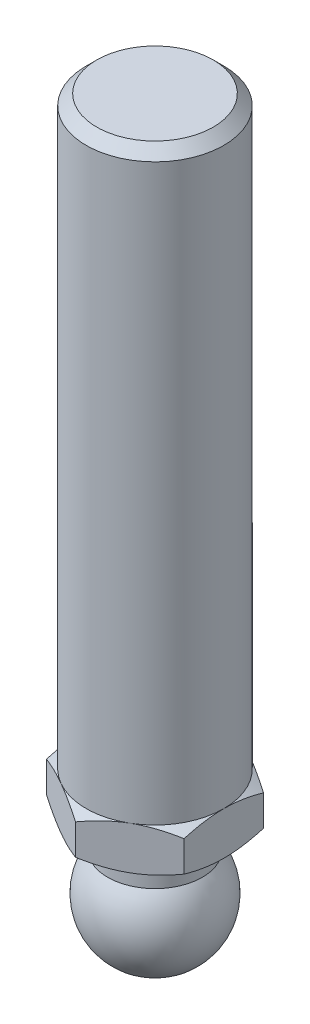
ISO-10303-21;
HEADER;
FILE_DESCRIPTION(('STEP AP214'),'2;1');
FILE_NAME('part.step','',(''),(''),'','','');
FILE_SCHEMA(('AUTOMOTIVE_DESIGN { 1 0 10303 214 1 1 1 1 }'));
ENDSEC;
DATA;
#1=APPLICATION_CONTEXT('core data for automotive mechanical design processes');
#2=APPLICATION_PROTOCOL_DEFINITION('international standard','automotive_design',2000,#1);
#3=PRODUCT_CONTEXT('',#1,'mechanical');
#4=PRODUCT('Part','Part','',(#3));
#5=PRODUCT_RELATED_PRODUCT_CATEGORY('part','',(#4));
#6=PRODUCT_DEFINITION_FORMATION('','',#4);
#7=PRODUCT_DEFINITION_CONTEXT('part definition',#1,'design');
#8=PRODUCT_DEFINITION('design','',#6,#7);
#9=PRODUCT_DEFINITION_SHAPE('','',#8);
#10=(LENGTH_UNIT() NAMED_UNIT(*) SI_UNIT(.MILLI.,.METRE.));
#11=(NAMED_UNIT(*) PLANE_ANGLE_UNIT() SI_UNIT($,.RADIAN.));
#12=(NAMED_UNIT(*) SI_UNIT($,.STERADIAN.) SOLID_ANGLE_UNIT());
#13=UNCERTAINTY_MEASURE_WITH_UNIT(LENGTH_MEASURE(1.E-05),#10,'distance_accuracy_value','');
#14=(GEOMETRIC_REPRESENTATION_CONTEXT(3) GLOBAL_UNCERTAINTY_ASSIGNED_CONTEXT((#13)) GLOBAL_UNIT_ASSIGNED_CONTEXT((#10,
#11,#12)) REPRESENTATION_CONTEXT('',''));
#15=CARTESIAN_POINT('',(0.,0.,0.));
#16=DIRECTION('',(0.,0.,1.));
#17=DIRECTION('',(1.,0.,0.));
#18=AXIS2_PLACEMENT_3D('',#15,#16,#17);
#19=CARTESIAN_POINT('',(0.,19.5,0.));
#20=DIRECTION('',(0.,-1.,0.));
#21=DIRECTION('',(0.,0.,-1.));
#22=AXIS2_PLACEMENT_3D('',#19,#20,#21);
#23=CONICAL_SURFACE('',#22,8.,1.0471975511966);
#24=CARTESIAN_POINT('',(-8.,14.714451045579,14.1889203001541));
#25=CARTESIAN_POINT('',(-8.,14.8842783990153,13.851186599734));
#26=CARTESIAN_POINT('',(-8.,15.0529801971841,13.5128811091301));
#27=CARTESIAN_POINT('',(-8.,15.3875863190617,12.8348638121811));
#28=CARTESIAN_POINT('',(-8.,15.553490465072,12.4951519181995));
#29=CARTESIAN_POINT('',(-8.,15.8822522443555,11.8134403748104));
#30=CARTESIAN_POINT('',(-8.,16.0451033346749,11.4714375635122));
#31=CARTESIAN_POINT('',(-8.,16.3666666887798,10.7854960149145));
#32=CARTESIAN_POINT('',(-8.,16.5253790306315,10.4415573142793));
#33=CARTESIAN_POINT('',(-8.,16.8449502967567,9.73535271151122));
#34=CARTESIAN_POINT('',(-8.,17.0055671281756,9.37297690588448));
#35=CARTESIAN_POINT('',(-8.,17.3197730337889,8.64516064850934));
#36=CARTESIAN_POINT('',(-8.,17.4733617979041,8.27972006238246));
#37=CARTESIAN_POINT('',(-8.,17.7714937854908,7.54540420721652));
#38=CARTESIAN_POINT('',(-8.,17.9160424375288,7.1765311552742));
#39=CARTESIAN_POINT('',(-8.,18.1936308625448,6.43449862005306));
#40=CARTESIAN_POINT('',(-8.,18.3266718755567,6.06133960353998));
#41=CARTESIAN_POINT('',(-8.,18.605819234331,5.22677195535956));
#42=CARTESIAN_POINT('',(-8.,18.7482891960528,4.76412920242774));
#43=CARTESIAN_POINT('',(-8.,19.0033463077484,3.83044032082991));
#44=CARTESIAN_POINT('',(-8.,19.115935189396,3.3593946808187));
#45=CARTESIAN_POINT('',(-8.,19.2546281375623,2.651184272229));
#46=CARTESIAN_POINT('',(-8.,19.2955954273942,2.41690742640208));
#47=CARTESIAN_POINT('',(-8.,19.3670123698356,1.94676929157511));
#48=CARTESIAN_POINT('',(-8.,19.3974635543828,1.71090823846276));
#49=CARTESIAN_POINT('',(-8.,19.4469446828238,1.23805721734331));
#50=CARTESIAN_POINT('',(-8.,19.4659782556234,1.0010676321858));
#51=CARTESIAN_POINT('',(-8.,19.4920206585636,0.526423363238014));
#52=CARTESIAN_POINT('',(-8.,19.499029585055,0.288768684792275));
#53=CARTESIAN_POINT('',(-8.,19.5007883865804,-0.188309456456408));
#54=CARTESIAN_POINT('',(-8.,19.4954490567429,-0.427733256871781));
#55=CARTESIAN_POINT('',(-8.,19.4725128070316,-0.905988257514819));
#56=CARTESIAN_POINT('',(-8.,19.4549157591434,-1.14481945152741));
#57=CARTESIAN_POINT('',(-8.,19.4080408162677,-1.62141631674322));
#58=CARTESIAN_POINT('',(-8.,19.3787584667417,-1.85918154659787));
#59=CARTESIAN_POINT('',(-8.,19.3094074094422,-2.33311174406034));
#60=CARTESIAN_POINT('',(-8.,19.2693385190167,-2.56927668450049));
#61=CARTESIAN_POINT('',(-8.,19.1329562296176,-3.28330816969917));
#62=CARTESIAN_POINT('',(-8.,19.0213579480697,-3.75830022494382));
#63=CARTESIAN_POINT('',(-8.,18.830875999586,-4.46428489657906));
#64=CARTESIAN_POINT('',(-8.,18.7635265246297,-4.69855285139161));
#65=CARTESIAN_POINT('',(-8.,18.6221775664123,-5.16507806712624));
#66=CARTESIAN_POINT('',(-8.,18.5481783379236,-5.39733540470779));
#67=CARTESIAN_POINT('',(-8.,18.3456232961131,-6.00705809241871));
#68=CARTESIAN_POINT('',(-8.,18.2123002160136,-6.38293491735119));
#69=CARTESIAN_POINT('',(-8.,17.9338794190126,-7.13030495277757));
#70=CARTESIAN_POINT('',(-8.,17.7887803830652,-7.50179766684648));
#71=CARTESIAN_POINT('',(-8.,17.4893388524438,-8.24128843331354));
#72=CARTESIAN_POINT('',(-8.,17.3349906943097,-8.60928418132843));
#73=CARTESIAN_POINT('',(-8.,17.0191219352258,-9.34215095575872));
#74=CARTESIAN_POINT('',(-8.,16.8576016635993,-9.70702212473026));
#75=CARTESIAN_POINT('',(-8.,16.5362228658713,-10.4179250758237));
#76=CARTESIAN_POINT('',(-8.,16.3766130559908,-10.7640696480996));
#77=CARTESIAN_POINT('',(-8.,16.0531867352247,-11.4543922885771));
#78=CARTESIAN_POINT('',(-8.,15.8893701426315,-11.798570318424));
#79=CARTESIAN_POINT('',(-8.,15.558638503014,-12.4845836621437));
#80=CARTESIAN_POINT('',(-8.,15.3917303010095,-12.8264222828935));
#81=CARTESIAN_POINT('',(-8.,15.0550779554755,-13.5086735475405));
#82=CARTESIAN_POINT('',(-8.,14.8853339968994,-13.8490862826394));
#83=CARTESIAN_POINT('',(-8.,14.714451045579,-14.1889203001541));
#84=B_SPLINE_CURVE_WITH_KNOTS('',3,(#24,#25,#26,#27,#28,#29,#30,#31,#32,#33,#34,#35,#36,#37,#38,
#39,#40,#41,#42,#43,#44,#45,#46,#47,#48,#49,#50,#51,#52,#53,#54,#55,#56,#57,#58,#59,#60,#61,#62,
#63,#64,#65,#66,#67,#68,#69,#70,#71,#72,#73,#74,#75,#76,#77,#78,#79,#80,#81,#82,#83),
.UNSPECIFIED.,.F.,.F.,(4,2,2,2,2,2,2,2,2,2,2,2,2,2,2,2,2,2,2,2,2,2,2,2,2,2,2,2,2,4),(0.,
1.13409047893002,2.26825272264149,3.40461779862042,4.5409614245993,5.73003075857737,
6.91915250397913,8.10755318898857,9.29582565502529,10.7473798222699,12.1988498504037,
12.9121466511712,13.6253394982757,14.3383055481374,15.0512658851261,15.7693927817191,
16.487527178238,17.2059355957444,17.9243561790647,19.38648697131,20.1177019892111,
20.8488890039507,22.0450800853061,23.2414053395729,24.4384707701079,25.6354812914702,
26.7789606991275,27.9224623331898,29.063679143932,30.2048218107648),.UNSPECIFIED.);
#85=CARTESIAN_POINT('',(-8.,18.7854688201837,4.61880215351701));
#86=VERTEX_POINT('',#85);
#87=CARTESIAN_POINT('',(-8.,19.5,0.));
#88=VERTEX_POINT('',#87);
#89=EDGE_CURVE('E253',#86,#88,#84,.T.);
#90=ORIENTED_EDGE('',*,*,#89,.F.);
#91=CARTESIAN_POINT('',(0.0002,18.7854021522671,9.23771977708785));
#92=CARTESIAN_POINT('',(-0.175648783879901,18.8440092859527,9.13619343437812));
#93=CARTESIAN_POINT('',(-0.352153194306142,18.8999565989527,9.03428856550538));
#94=CARTESIAN_POINT('',(-0.706595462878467,19.0057989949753,8.82965122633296));
#95=CARTESIAN_POINT('',(-0.884533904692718,19.0556914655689,8.72691841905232));
#96=CARTESIAN_POINT('',(-1.42119823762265,19.1953072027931,8.41707512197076));
#97=CARTESIAN_POINT('',(-1.78204258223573,19.2747188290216,8.20874154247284));
#98=CARTESIAN_POINT('',(-2.32203917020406,19.3678383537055,7.89697436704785));
#99=CARTESIAN_POINT('',(-2.49957818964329,19.3943654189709,7.79447216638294));
#100=CARTESIAN_POINT('',(-2.85545911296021,19.4388468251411,7.58900421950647));
#101=CARTESIAN_POINT('',(-3.03380094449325,19.4568019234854,7.4860385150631));
#102=CARTESIAN_POINT('',(-3.3907916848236,19.4836843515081,7.27992981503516));
#103=CARTESIAN_POINT('',(-3.56944001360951,19.4926219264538,7.17678715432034));
#104=CARTESIAN_POINT('',(-3.92690170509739,19.5012776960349,6.97040655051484));
#105=CARTESIAN_POINT('',(-4.10571506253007,19.5009961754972,6.86716861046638));
#106=CARTESIAN_POINT('',(-4.44001336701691,19.4918549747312,6.67416139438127));
#107=CARTESIAN_POINT('',(-4.59552190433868,19.4841103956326,6.58437849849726));
#108=CARTESIAN_POINT('',(-4.90617476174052,19.4617988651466,6.40502298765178));
#109=CARTESIAN_POINT('',(-5.06131905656,19.4472314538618,6.31545038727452));
#110=CARTESIAN_POINT('',(-5.52615131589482,19.3936393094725,6.04707935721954));
#111=CARTESIAN_POINT('',(-5.83501648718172,19.3447313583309,5.86875596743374));
#112=CARTESIAN_POINT('',(-6.4560232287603,19.2224605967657,5.51021755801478));
#113=CARTESIAN_POINT('',(-6.76808554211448,19.148579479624,5.33004829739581));
#114=CARTESIAN_POINT('',(-7.38755648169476,18.980899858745,4.97239658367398));
#115=CARTESIAN_POINT('',(-7.69497304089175,18.8871407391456,4.79490955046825));
#116=CARTESIAN_POINT('',(-8.0002,18.7854021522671,4.61868668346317));
#117=B_SPLINE_CURVE_WITH_KNOTS('',3,(#91,#92,#93,#94,#95,#96,#97,#98,#99,#100,#101,#102,#103,
#104,#105,#106,#107,#108,#109,#110,#111,#112,#113,#114,#115,#116),.UNSPECIFIED.,.F.,.F.,(4,2,2,
2,2,2,2,2,2,2,2,2,4),(0.,0.633973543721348,1.26821965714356,2.53934712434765,3.15934343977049,
3.77928496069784,4.39852133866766,5.01773858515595,5.55680239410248,6.09590254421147,
7.17487077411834,8.27776850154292,9.37850115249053),.UNSPECIFIED.);
#118=CARTESIAN_POINT('',(-4.,19.5,6.92820323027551));
#119=VERTEX_POINT('',#118);
#120=EDGE_CURVE('E141',#119,#86,#117,.T.);
#121=ORIENTED_EDGE('',*,*,#120,.F.);
#122=CARTESIAN_POINT('',(0.,19.5,0.));
#123=DIRECTION('',(0.,-1.,0.));
#124=DIRECTION('',(0.,0.,-1.));
#125=AXIS2_PLACEMENT_3D('',#122,#123,#124);
#126=CIRCLE('',#125,8.);
#127=EDGE_CURVE('E223',#119,#88,#126,.T.);
#128=ORIENTED_EDGE('',*,*,#127,.T.);
#129=EDGE_LOOP('',(#90,#121,#128));
#130=FACE_BOUND('',#129,.T.);
#131=ADVANCED_FACE('F14',(#130),#23,.T.);
#132=CARTESIAN_POINT('',(-8.,18.7854688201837,-4.61880215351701));
#133=VERTEX_POINT('',#132);
#134=EDGE_CURVE('E255',#88,#133,#84,.T.);
#135=ORIENTED_EDGE('',*,*,#134,.F.);
#136=CARTESIAN_POINT('',(-4.,19.5,-6.92820323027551));
#137=VERTEX_POINT('',#136);
#138=EDGE_CURVE('E238',#88,#137,#126,.T.);
#139=ORIENTED_EDGE('',*,*,#138,.T.);
#140=CARTESIAN_POINT('',(-8.0002,18.7854021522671,-4.61868668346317));
#141=CARTESIAN_POINT('',(-7.8243512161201,18.8440092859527,-4.7202130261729));
#142=CARTESIAN_POINT('',(-7.64784680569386,18.8999565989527,-4.82211789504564));
#143=CARTESIAN_POINT('',(-7.29340453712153,19.0057989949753,-5.02675523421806));
#144=CARTESIAN_POINT('',(-7.11546609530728,19.0556914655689,-5.1294880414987));
#145=CARTESIAN_POINT('',(-6.57880176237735,19.1953072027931,-5.43933133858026));
#146=CARTESIAN_POINT('',(-6.21795741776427,19.2747188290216,-5.64766491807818));
#147=CARTESIAN_POINT('',(-5.67796082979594,19.3678383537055,-5.95943209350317));
#148=CARTESIAN_POINT('',(-5.50042181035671,19.3943654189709,-6.06193429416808));
#149=CARTESIAN_POINT('',(-5.14454088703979,19.4388468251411,-6.26740224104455));
#150=CARTESIAN_POINT('',(-4.96619905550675,19.4568019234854,-6.37036794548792));
#151=CARTESIAN_POINT('',(-4.6092083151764,19.4836843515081,-6.57647664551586));
#152=CARTESIAN_POINT('',(-4.43055998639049,19.4926219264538,-6.67961930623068));
#153=CARTESIAN_POINT('',(-4.07309829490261,19.5012776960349,-6.88599991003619));
#154=CARTESIAN_POINT('',(-3.89428493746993,19.5009961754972,-6.98923785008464));
#155=CARTESIAN_POINT('',(-3.55998663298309,19.4918549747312,-7.18224506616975));
#156=CARTESIAN_POINT('',(-3.40447809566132,19.4841103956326,-7.27202796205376));
#157=CARTESIAN_POINT('',(-3.09382523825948,19.4617988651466,-7.45138347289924));
#158=CARTESIAN_POINT('',(-2.93868094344,19.4472314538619,-7.54095607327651));
#159=CARTESIAN_POINT('',(-2.47384868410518,19.3936393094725,-7.80932710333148));
#160=CARTESIAN_POINT('',(-2.16498351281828,19.3447313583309,-7.98765049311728));
#161=CARTESIAN_POINT('',(-1.5439767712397,19.2224605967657,-8.34618890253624));
#162=CARTESIAN_POINT('',(-1.23191445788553,19.148579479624,-8.52635816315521));
#163=CARTESIAN_POINT('',(-0.612443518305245,18.980899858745,-8.88400987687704));
#164=CARTESIAN_POINT('',(-0.305026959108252,18.8871407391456,-9.06149691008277));
#165=CARTESIAN_POINT('',(0.000199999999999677,18.7854021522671,-9.23771977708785));
#166=B_SPLINE_CURVE_WITH_KNOTS('',3,(#140,#141,#142,#143,#144,#145,#146,#147,#148,#149,#150,
#151,#152,#153,#154,#155,#156,#157,#158,#159,#160,#161,#162,#163,#164,#165),.UNSPECIFIED.,.F.,
.F.,(4,2,2,2,2,2,2,2,2,2,2,2,4),(0.,0.633973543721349,1.26821965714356,2.53934712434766,
3.15934343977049,3.77928496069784,4.39852133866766,5.01773858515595,5.55680239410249,
6.09590254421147,7.17487077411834,8.27776850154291,9.37850115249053),.UNSPECIFIED.);
#167=EDGE_CURVE('E296',#133,#137,#166,.T.);
#168=ORIENTED_EDGE('',*,*,#167,.F.);
#169=EDGE_LOOP('',(#135,#139,#168));
#170=FACE_BOUND('',#169,.T.);
#171=ADVANCED_FACE('F179',(#170),#23,.T.);
#172=CARTESIAN_POINT('',(0.,18.7854688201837,-9.23760430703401));
#173=VERTEX_POINT('',#172);
#174=EDGE_CURVE('E291',#137,#173,#166,.T.);
#175=ORIENTED_EDGE('',*,*,#174,.F.);
#176=CARTESIAN_POINT('',(4.,19.5,-6.92820323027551));
#177=VERTEX_POINT('',#176);
#178=EDGE_CURVE('E232',#137,#177,#126,.T.);
#179=ORIENTED_EDGE('',*,*,#178,.T.);
#180=CARTESIAN_POINT('',(-0.0002,18.7854021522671,-9.23771977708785));
#181=CARTESIAN_POINT('',(0.175648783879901,18.8440092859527,-9.13619343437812));
#182=CARTESIAN_POINT('',(0.352153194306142,18.8999565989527,-9.03428856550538));
#183=CARTESIAN_POINT('',(0.706595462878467,19.0057989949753,-8.82965122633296));
#184=CARTESIAN_POINT('',(0.884533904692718,19.0556914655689,-8.72691841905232));
#185=CARTESIAN_POINT('',(1.42119823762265,19.1953072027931,-8.41707512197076));
#186=CARTESIAN_POINT('',(1.78204258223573,19.2747188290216,-8.20874154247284));
#187=CARTESIAN_POINT('',(2.32203917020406,19.3678383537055,-7.89697436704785));
#188=CARTESIAN_POINT('',(2.49957818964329,19.3943654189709,-7.79447216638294));
#189=CARTESIAN_POINT('',(2.85545911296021,19.4388468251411,-7.58900421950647));
#190=CARTESIAN_POINT('',(3.03380094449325,19.4568019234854,-7.4860385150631));
#191=CARTESIAN_POINT('',(3.3907916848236,19.4836843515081,-7.27992981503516));
#192=CARTESIAN_POINT('',(3.56944001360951,19.4926219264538,-7.17678715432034));
#193=CARTESIAN_POINT('',(3.92690170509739,19.5012776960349,-6.97040655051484));
#194=CARTESIAN_POINT('',(4.10571506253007,19.5009961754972,-6.86716861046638));
#195=CARTESIAN_POINT('',(4.44001336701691,19.4918549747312,-6.67416139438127));
#196=CARTESIAN_POINT('',(4.59552190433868,19.4841103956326,-6.58437849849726));
#197=CARTESIAN_POINT('',(4.90617476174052,19.4617988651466,-6.40502298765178));
#198=CARTESIAN_POINT('',(5.06131905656,19.4472314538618,-6.31545038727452));
#199=CARTESIAN_POINT('',(5.52615131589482,19.3936393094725,-6.04707935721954));
#200=CARTESIAN_POINT('',(5.83501648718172,19.3447313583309,-5.86875596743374));
#201=CARTESIAN_POINT('',(6.4560232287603,19.2224605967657,-5.51021755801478));
#202=CARTESIAN_POINT('',(6.76808554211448,19.148579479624,-5.33004829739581));
#203=CARTESIAN_POINT('',(7.38755648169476,18.980899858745,-4.97239658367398));
#204=CARTESIAN_POINT('',(7.69497304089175,18.8871407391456,-4.79490955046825));
#205=CARTESIAN_POINT('',(8.0002,18.7854021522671,-4.61868668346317));
#206=B_SPLINE_CURVE_WITH_KNOTS('',3,(#180,#181,#182,#183,#184,#185,#186,#187,#188,#189,#190,
#191,#192,#193,#194,#195,#196,#197,#198,#199,#200,#201,#202,#203,#204,#205),.UNSPECIFIED.,.F.,
.F.,(4,2,2,2,2,2,2,2,2,2,2,2,4),(0.,0.633973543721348,1.26821965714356,2.53934712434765,
3.15934343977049,3.77928496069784,4.39852133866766,5.01773858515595,5.55680239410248,
6.09590254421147,7.17487077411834,8.27776850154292,9.37850115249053),.UNSPECIFIED.);
#207=EDGE_CURVE('E302',#173,#177,#206,.T.);
#208=ORIENTED_EDGE('',*,*,#207,.F.);
#209=EDGE_LOOP('',(#175,#179,#208));
#210=FACE_BOUND('',#209,.T.);
#211=ADVANCED_FACE('F186',(#210),#23,.T.);
#212=CARTESIAN_POINT('',(8.,18.7854688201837,-4.61880215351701));
#213=VERTEX_POINT('',#212);
#214=EDGE_CURVE('E304',#177,#213,#206,.T.);
#215=ORIENTED_EDGE('',*,*,#214,.F.);
#216=CARTESIAN_POINT('',(8.,19.5,0.));
#217=VERTEX_POINT('',#216);
#218=EDGE_CURVE('E229',#177,#217,#126,.T.);
#219=ORIENTED_EDGE('',*,*,#218,.T.);
#220=CARTESIAN_POINT('',(8.,14.714451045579,-14.1889203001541));
#221=CARTESIAN_POINT('',(8.,14.8842783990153,-13.851186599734));
#222=CARTESIAN_POINT('',(8.,15.0529801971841,-13.5128811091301));
#223=CARTESIAN_POINT('',(8.,15.3875863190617,-12.8348638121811));
#224=CARTESIAN_POINT('',(8.,15.553490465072,-12.4951519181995));
#225=CARTESIAN_POINT('',(8.,15.8822522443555,-11.8134403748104));
#226=CARTESIAN_POINT('',(8.,16.0451033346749,-11.4714375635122));
#227=CARTESIAN_POINT('',(8.,16.3666666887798,-10.7854960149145));
#228=CARTESIAN_POINT('',(8.,16.5253790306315,-10.4415573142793));
#229=CARTESIAN_POINT('',(8.,16.8449502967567,-9.73535271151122));
#230=CARTESIAN_POINT('',(8.,17.0055671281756,-9.37297690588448));
#231=CARTESIAN_POINT('',(8.,17.3197730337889,-8.64516064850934));
#232=CARTESIAN_POINT('',(8.,17.4733617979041,-8.27972006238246));
#233=CARTESIAN_POINT('',(8.,17.7714937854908,-7.54540420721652));
#234=CARTESIAN_POINT('',(8.,17.9160424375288,-7.1765311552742));
#235=CARTESIAN_POINT('',(8.,18.1936308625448,-6.43449862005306));
#236=CARTESIAN_POINT('',(8.,18.3266718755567,-6.06133960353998));
#237=CARTESIAN_POINT('',(8.,18.605819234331,-5.22677195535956));
#238=CARTESIAN_POINT('',(8.,18.7482891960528,-4.76412920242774));
#239=CARTESIAN_POINT('',(8.,19.0033463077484,-3.83044032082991));
#240=CARTESIAN_POINT('',(8.,19.115935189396,-3.3593946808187));
#241=CARTESIAN_POINT('',(8.,19.2546281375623,-2.651184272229));
#242=CARTESIAN_POINT('',(8.,19.2955954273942,-2.41690742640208));
#243=CARTESIAN_POINT('',(8.,19.3670123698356,-1.94676929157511));
#244=CARTESIAN_POINT('',(8.,19.3974635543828,-1.71090823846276));
#245=CARTESIAN_POINT('',(8.,19.4469446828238,-1.23805721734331));
#246=CARTESIAN_POINT('',(8.,19.4659782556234,-1.0010676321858));
#247=CARTESIAN_POINT('',(8.,19.4920206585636,-0.526423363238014));
#248=CARTESIAN_POINT('',(8.,19.499029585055,-0.288768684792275));
#249=CARTESIAN_POINT('',(8.,19.5007883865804,0.188309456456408));
#250=CARTESIAN_POINT('',(8.,19.4954490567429,0.427733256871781));
#251=CARTESIAN_POINT('',(8.,19.4725128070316,0.905988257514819));
#252=CARTESIAN_POINT('',(8.,19.4549157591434,1.14481945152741));
#253=CARTESIAN_POINT('',(8.,19.4080408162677,1.62141631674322));
#254=CARTESIAN_POINT('',(8.,19.3787584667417,1.85918154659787));
#255=CARTESIAN_POINT('',(8.,19.3094074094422,2.33311174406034));
#256=CARTESIAN_POINT('',(8.,19.2693385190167,2.56927668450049));
#257=CARTESIAN_POINT('',(8.,19.1329562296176,3.28330816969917));
#258=CARTESIAN_POINT('',(8.,19.0213579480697,3.75830022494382));
#259=CARTESIAN_POINT('',(8.,18.830875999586,4.46428489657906));
#260=CARTESIAN_POINT('',(8.,18.7635265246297,4.69855285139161));
#261=CARTESIAN_POINT('',(8.,18.6221775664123,5.16507806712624));
#262=CARTESIAN_POINT('',(8.,18.5481783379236,5.39733540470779));
#263=CARTESIAN_POINT('',(8.,18.3456232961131,6.00705809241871));
#264=CARTESIAN_POINT('',(8.,18.2123002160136,6.38293491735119));
#265=CARTESIAN_POINT('',(8.,17.9338794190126,7.13030495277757));
#266=CARTESIAN_POINT('',(8.,17.7887803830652,7.50179766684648));
#267=CARTESIAN_POINT('',(8.,17.4893388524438,8.24128843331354));
#268=CARTESIAN_POINT('',(8.,17.3349906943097,8.60928418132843));
#269=CARTESIAN_POINT('',(8.,17.0191219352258,9.34215095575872));
#270=CARTESIAN_POINT('',(8.,16.8576016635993,9.70702212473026));
#271=CARTESIAN_POINT('',(8.,16.5362228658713,10.4179250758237));
#272=CARTESIAN_POINT('',(8.,16.3766130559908,10.7640696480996));
#273=CARTESIAN_POINT('',(8.,16.0531867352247,11.4543922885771));
#274=CARTESIAN_POINT('',(8.,15.8893701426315,11.798570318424));
#275=CARTESIAN_POINT('',(8.,15.558638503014,12.4845836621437));
#276=CARTESIAN_POINT('',(8.,15.3917303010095,12.8264222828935));
#277=CARTESIAN_POINT('',(8.,15.0550779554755,13.5086735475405));
#278=CARTESIAN_POINT('',(8.,14.8853339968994,13.8490862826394));
#279=CARTESIAN_POINT('',(8.,14.714451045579,14.1889203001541));
#280=B_SPLINE_CURVE_WITH_KNOTS('',3,(#220,#221,#222,#223,#224,#225,#226,#227,#228,#229,#230,
#231,#232,#233,#234,#235,#236,#237,#238,#239,#240,#241,#242,#243,#244,#245,#246,#247,#248,#249,
#250,#251,#252,#253,#254,#255,#256,#257,#258,#259,#260,#261,#262,#263,#264,#265,#266,#267,#268,
#269,#270,#271,#272,#273,#274,#275,#276,#277,#278,#279),.UNSPECIFIED.,.F.,.F.,(4,2,2,2,2,2,2,2,
2,2,2,2,2,2,2,2,2,2,2,2,2,2,2,2,2,2,2,2,2,4),(0.,1.13409047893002,2.26825272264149,
3.40461779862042,4.5409614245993,5.73003075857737,6.91915250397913,8.10755318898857,
9.29582565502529,10.7473798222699,12.1988498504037,12.9121466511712,13.6253394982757,
14.3383055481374,15.0512658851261,15.7693927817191,16.487527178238,17.2059355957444,
17.9243561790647,19.38648697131,20.1177019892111,20.8488890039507,22.0450800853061,
23.2414053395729,24.4384707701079,25.6354812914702,26.7789606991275,27.9224623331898,
29.063679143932,30.2048218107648),.UNSPECIFIED.);
#281=EDGE_CURVE('E319',#213,#217,#280,.T.);
#282=ORIENTED_EDGE('',*,*,#281,.F.);
#283=EDGE_LOOP('',(#215,#219,#282));
#284=FACE_BOUND('',#283,.T.);
#285=ADVANCED_FACE('F201',(#284),#23,.T.);
#286=CARTESIAN_POINT('',(8.,18.7854688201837,4.61880215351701));
#287=VERTEX_POINT('',#286);
#288=EDGE_CURVE('E227',#217,#287,#280,.T.);
#289=ORIENTED_EDGE('',*,*,#288,.F.);
#290=CARTESIAN_POINT('',(4.,19.5,6.92820323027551));
#291=VERTEX_POINT('',#290);
#292=EDGE_CURVE('E220',#217,#291,#126,.T.);
#293=ORIENTED_EDGE('',*,*,#292,.T.);
#294=CARTESIAN_POINT('',(8.0002,18.7854021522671,4.61868668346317));
#295=CARTESIAN_POINT('',(7.8243512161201,18.8440092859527,4.7202130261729));
#296=CARTESIAN_POINT('',(7.64784680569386,18.8999565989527,4.82211789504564));
#297=CARTESIAN_POINT('',(7.29340453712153,19.0057989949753,5.02675523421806));
#298=CARTESIAN_POINT('',(7.11546609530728,19.0556914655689,5.1294880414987));
#299=CARTESIAN_POINT('',(6.57880176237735,19.1953072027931,5.43933133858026));
#300=CARTESIAN_POINT('',(6.21795741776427,19.2747188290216,5.64766491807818));
#301=CARTESIAN_POINT('',(5.67796082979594,19.3678383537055,5.95943209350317));
#302=CARTESIAN_POINT('',(5.50042181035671,19.3943654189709,6.06193429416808));
#303=CARTESIAN_POINT('',(5.14454088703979,19.4388468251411,6.26740224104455));
#304=CARTESIAN_POINT('',(4.96619905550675,19.4568019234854,6.37036794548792));
#305=CARTESIAN_POINT('',(4.6092083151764,19.4836843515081,6.57647664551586));
#306=CARTESIAN_POINT('',(4.43055998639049,19.4926219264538,6.67961930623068));
#307=CARTESIAN_POINT('',(4.07309829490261,19.5012776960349,6.88599991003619));
#308=CARTESIAN_POINT('',(3.89428493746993,19.5009961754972,6.98923785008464));
#309=CARTESIAN_POINT('',(3.55998663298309,19.4918549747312,7.18224506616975));
#310=CARTESIAN_POINT('',(3.40447809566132,19.4841103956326,7.27202796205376));
#311=CARTESIAN_POINT('',(3.09382523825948,19.4617988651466,7.45138347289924));
#312=CARTESIAN_POINT('',(2.93868094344,19.4472314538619,7.54095607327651));
#313=CARTESIAN_POINT('',(2.47384868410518,19.3936393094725,7.80932710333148));
#314=CARTESIAN_POINT('',(2.16498351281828,19.3447313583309,7.98765049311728));
#315=CARTESIAN_POINT('',(1.5439767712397,19.2224605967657,8.34618890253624));
#316=CARTESIAN_POINT('',(1.23191445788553,19.148579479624,8.52635816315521));
#317=CARTESIAN_POINT('',(0.612443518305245,18.980899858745,8.88400987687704));
#318=CARTESIAN_POINT('',(0.305026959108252,18.8871407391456,9.06149691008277));
#319=CARTESIAN_POINT('',(-0.000199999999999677,18.7854021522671,9.23771977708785));
#320=B_SPLINE_CURVE_WITH_KNOTS('',3,(#294,#295,#296,#297,#298,#299,#300,#301,#302,#303,#304,
#305,#306,#307,#308,#309,#310,#311,#312,#313,#314,#315,#316,#317,#318,#319),.UNSPECIFIED.,.F.,
.F.,(4,2,2,2,2,2,2,2,2,2,2,2,4),(0.,0.633973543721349,1.26821965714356,2.53934712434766,
3.15934343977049,3.77928496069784,4.39852133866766,5.01773858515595,5.55680239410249,
6.09590254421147,7.17487077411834,8.27776850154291,9.37850115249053),.UNSPECIFIED.);
#321=EDGE_CURVE('E210',#287,#291,#320,.T.);
#322=ORIENTED_EDGE('',*,*,#321,.F.);
#323=EDGE_LOOP('',(#289,#293,#322));
#324=FACE_BOUND('',#323,.T.);
#325=ADVANCED_FACE('F192',(#324),#23,.T.);
#326=CARTESIAN_POINT('',(0.,18.7854688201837,9.23760430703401));
#327=VERTEX_POINT('',#326);
#328=EDGE_CURVE('E205',#291,#327,#320,.T.);
#329=ORIENTED_EDGE('',*,*,#328,.F.);
#330=EDGE_CURVE('E207',#291,#119,#126,.T.);
#331=ORIENTED_EDGE('',*,*,#330,.T.);
#332=EDGE_CURVE('E29',#327,#119,#117,.T.);
#333=ORIENTED_EDGE('',*,*,#332,.F.);
#334=EDGE_LOOP('',(#329,#331,#333));
#335=FACE_BOUND('',#334,.T.);
#336=ADVANCED_FACE('F181',(#335),#23,.T.);
#337=CARTESIAN_POINT('',(0.,87.5,0.));
#338=DIRECTION('',(0.,-1.,0.));
#339=DIRECTION('',(0.,0.,-1.));
#340=AXIS2_PLACEMENT_3D('',#337,#338,#339);
#341=PLANE('',#340);
#342=CARTESIAN_POINT('',(0.,87.5,0.));
#343=DIRECTION('',(0.,-1.,0.));
#344=DIRECTION('',(0.,0.,-1.));
#345=AXIS2_PLACEMENT_3D('',#342,#343,#344);
#346=CIRCLE('',#345,6.773);
#347=CARTESIAN_POINT('',(0.,87.5,-6.773));
#348=VERTEX_POINT('',#347);
#349=EDGE_CURVE('E9',#348,#348,#346,.T.);
#350=ORIENTED_EDGE('',*,*,#349,.F.);
#351=EDGE_LOOP('',(#350));
#352=FACE_BOUND('',#351,.T.);
#353=ADVANCED_FACE('F16',(#352),#341,.F.);
#354=CARTESIAN_POINT('',(0.,87.5,0.));
#355=DIRECTION('',(0.,-1.,0.));
#356=DIRECTION('',(0.,0.,-1.));
#357=AXIS2_PLACEMENT_3D('',#354,#355,#356);
#358=CONICAL_SURFACE('',#357,6.773,0.785398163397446);
#359=CARTESIAN_POINT('',(0.,86.273,0.));
#360=DIRECTION('',(0.,-1.,0.));
#361=DIRECTION('',(0.,0.,-1.));
#362=AXIS2_PLACEMENT_3D('',#359,#360,#361);
#363=CIRCLE('',#362,8.);
#364=CARTESIAN_POINT('',(0.,86.273,-8.));
#365=VERTEX_POINT('',#364);
#366=EDGE_CURVE('E22',#365,#365,#363,.T.);
#367=ORIENTED_EDGE('',*,*,#366,.F.);
#368=EDGE_LOOP('',(#367));
#369=FACE_BOUND('',#368,.T.);
#370=ORIENTED_EDGE('',*,*,#349,.T.);
#371=EDGE_LOOP('',(#370));
#372=FACE_BOUND('',#371,.T.);
#373=ADVANCED_FACE('F199',(#369,#372),#358,.T.);
#374=CARTESIAN_POINT('',(0.,0.,0.));
#375=DIRECTION('',(0.,-1.,0.));
#376=DIRECTION('',(0.,0.,-1.));
#377=AXIS2_PLACEMENT_3D('',#374,#375,#376);
#378=CYLINDRICAL_SURFACE('',#377,8.);
#379=ORIENTED_EDGE('',*,*,#292,.F.);
#380=ORIENTED_EDGE('',*,*,#218,.F.);
#381=ORIENTED_EDGE('',*,*,#178,.F.);
#382=ORIENTED_EDGE('',*,*,#138,.F.);
#383=ORIENTED_EDGE('',*,*,#127,.F.);
#384=ORIENTED_EDGE('',*,*,#330,.F.);
#385=EDGE_LOOP('',(#379,#380,#381,#382,#383,#384));
#386=FACE_BOUND('',#385,.T.);
#387=ORIENTED_EDGE('',*,*,#366,.T.);
#388=EDGE_LOOP('',(#387));
#389=FACE_BOUND('',#388,.T.);
#390=ADVANCED_FACE('F217',(#386,#389),#378,.T.);
#391=CARTESIAN_POINT('',(-8.,14.3,-4.61880215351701));
#392=DIRECTION('',(-1.,0.,0.));
#393=DIRECTION('',(0.,0.,1.));
#394=AXIS2_PLACEMENT_3D('',#391,#392,#393);
#395=PLANE('',#394);
#396=ORIENTED_EDGE('',*,*,#89,.T.);
#397=ORIENTED_EDGE('',*,*,#134,.T.);
#398=DIRECTION('',(0.,1.,0.));
#399=VECTOR('',#398,1.);
#400=CARTESIAN_POINT('',(-8.,14.3,-4.61880215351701));
#401=LINE('',#400,#399);
#402=CARTESIAN_POINT('',(-8.,15.2145311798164,-4.61880215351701));
#403=VERTEX_POINT('',#402);
#404=EDGE_CURVE('E120',#403,#133,#401,.T.);
#405=ORIENTED_EDGE('',*,*,#404,.F.);
#406=CARTESIAN_POINT('',(-8.,19.285548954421,-14.1889203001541));
#407=CARTESIAN_POINT('',(-8.,19.1157216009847,-13.851186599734));
#408=CARTESIAN_POINT('',(-8.,18.9470198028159,-13.5128811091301));
#409=CARTESIAN_POINT('',(-8.,18.6124136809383,-12.8348638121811));
#410=CARTESIAN_POINT('',(-8.,18.446509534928,-12.4951519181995));
#411=CARTESIAN_POINT('',(-8.,18.1177477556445,-11.8134403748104));
#412=CARTESIAN_POINT('',(-8.,17.9548966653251,-11.4714375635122));
#413=CARTESIAN_POINT('',(-8.,17.6333333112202,-10.7854960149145));
#414=CARTESIAN_POINT('',(-8.,17.4746209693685,-10.4415573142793));
#415=CARTESIAN_POINT('',(-8.,17.1550497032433,-9.7353527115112));
#416=CARTESIAN_POINT('',(-8.,16.9944328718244,-9.37297690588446));
#417=CARTESIAN_POINT('',(-8.,16.680226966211,-8.64516064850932));
#418=CARTESIAN_POINT('',(-8.,16.5266382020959,-8.27972006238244));
#419=CARTESIAN_POINT('',(-8.,16.2285062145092,-7.54540420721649));
#420=CARTESIAN_POINT('',(-8.,16.0839575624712,-7.17653115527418));
#421=CARTESIAN_POINT('',(-8.,15.8063691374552,-6.43449862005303));
#422=CARTESIAN_POINT('',(-8.,15.6733281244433,-6.06133960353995));
#423=CARTESIAN_POINT('',(-8.,15.394180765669,-5.22677195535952));
#424=CARTESIAN_POINT('',(-8.,15.2517108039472,-4.7641292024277));
#425=CARTESIAN_POINT('',(-8.,14.9966536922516,-3.83044032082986));
#426=CARTESIAN_POINT('',(-8.,14.884064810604,-3.35939468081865));
#427=CARTESIAN_POINT('',(-8.,14.7453718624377,-2.65118427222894));
#428=CARTESIAN_POINT('',(-8.,14.7044045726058,-2.41690742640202));
#429=CARTESIAN_POINT('',(-8.,14.6329876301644,-1.94676929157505));
#430=CARTESIAN_POINT('',(-8.,14.6025364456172,-1.7109082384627));
#431=CARTESIAN_POINT('',(-8.,14.5530553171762,-1.23805721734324));
#432=CARTESIAN_POINT('',(-8.,14.5340217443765,-1.00106763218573));
#433=CARTESIAN_POINT('',(-8.,14.5079793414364,-0.52642336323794));
#434=CARTESIAN_POINT('',(-8.,14.500970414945,-0.288768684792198));
#435=CARTESIAN_POINT('',(-8.,14.4992116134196,0.188309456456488));
#436=CARTESIAN_POINT('',(-8.,14.5045509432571,0.427733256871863));
#437=CARTESIAN_POINT('',(-8.,14.5274871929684,0.905988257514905));
#438=CARTESIAN_POINT('',(-8.,14.5450842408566,1.1448194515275));
#439=CARTESIAN_POINT('',(-8.,14.5919591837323,1.62141631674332));
#440=CARTESIAN_POINT('',(-8.,14.6212415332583,1.85918154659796));
#441=CARTESIAN_POINT('',(-8.,14.6905925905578,2.33311174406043));
#442=CARTESIAN_POINT('',(-8.,14.7306614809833,2.56927668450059));
#443=CARTESIAN_POINT('',(-8.,14.8670437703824,3.28330816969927));
#444=CARTESIAN_POINT('',(-8.,14.9786420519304,3.75830022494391));
#445=CARTESIAN_POINT('',(-8.,15.169124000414,4.46428489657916));
#446=CARTESIAN_POINT('',(-8.,15.2364734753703,4.69855285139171));
#447=CARTESIAN_POINT('',(-8.,15.3778224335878,5.16507806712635));
#448=CARTESIAN_POINT('',(-8.,15.4518216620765,5.3973354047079));
#449=CARTESIAN_POINT('',(-8.,15.654376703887,6.0070580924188));
#450=CARTESIAN_POINT('',(-8.,15.7876997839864,6.38293491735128));
#451=CARTESIAN_POINT('',(-8.,16.0661205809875,7.13030495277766));
#452=CARTESIAN_POINT('',(-8.,16.2112196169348,7.50179766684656));
#453=CARTESIAN_POINT('',(-8.,16.5106611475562,8.2412884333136));
#454=CARTESIAN_POINT('',(-8.,16.6650093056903,8.60928418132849));
#455=CARTESIAN_POINT('',(-8.,16.9808780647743,9.34215095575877));
#456=CARTESIAN_POINT('',(-8.,17.1423983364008,9.7070221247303));
#457=CARTESIAN_POINT('',(-8.,17.4637771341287,10.4179250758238));
#458=CARTESIAN_POINT('',(-8.,17.6233869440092,10.7640696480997));
#459=CARTESIAN_POINT('',(-8.,17.9468132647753,11.4543922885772));
#460=CARTESIAN_POINT('',(-8.,18.1106298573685,11.7985703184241));
#461=CARTESIAN_POINT('',(-8.,18.441361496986,12.4845836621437));
#462=CARTESIAN_POINT('',(-8.,18.6082696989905,12.8264222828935));
#463=CARTESIAN_POINT('',(-8.,18.9449220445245,13.5086735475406));
#464=CARTESIAN_POINT('',(-8.,19.1146660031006,13.8490862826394));
#465=CARTESIAN_POINT('',(-8.,19.285548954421,14.1889203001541));
#466=B_SPLINE_CURVE_WITH_KNOTS('',3,(#406,#407,#408,#409,#410,#411,#412,#413,#414,#415,#416,
#417,#418,#419,#420,#421,#422,#423,#424,#425,#426,#427,#428,#429,#430,#431,#432,#433,#434,#435,
#436,#437,#438,#439,#440,#441,#442,#443,#444,#445,#446,#447,#448,#449,#450,#451,#452,#453,#454,
#455,#456,#457,#458,#459,#460,#461,#462,#463,#464,#465),.UNSPECIFIED.,.F.,.F.,(4,2,2,2,2,2,2,2,
2,2,2,2,2,2,2,2,2,2,2,2,2,2,2,2,2,2,2,2,2,4),(0.,1.13409047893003,2.2682527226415,
3.40461779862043,4.54096142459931,5.7300307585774,6.91915250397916,8.1075531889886,
9.29582565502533,10.7473798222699,12.1988498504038,12.9121466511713,13.6253394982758,
14.3383055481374,15.0512658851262,15.7693927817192,16.4875271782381,17.2059355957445,
17.9243561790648,19.3864869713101,20.1177019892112,20.8488890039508,22.0450800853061,
23.2414053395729,24.4384707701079,25.6354812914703,26.7789606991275,27.9224623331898,
29.063679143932,30.2048218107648),.UNSPECIFIED.);
#467=CARTESIAN_POINT('',(-8.,14.5,0.));
#468=VERTEX_POINT('',#467);
#469=EDGE_CURVE('E263',#403,#468,#466,.T.);
#470=ORIENTED_EDGE('',*,*,#469,.T.);
#471=CARTESIAN_POINT('',(-8.,15.2145311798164,4.61880215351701));
#472=VERTEX_POINT('',#471);
#473=EDGE_CURVE('E264',#468,#472,#466,.T.);
#474=ORIENTED_EDGE('',*,*,#473,.T.);
#475=DIRECTION('',(0.,1.,0.));
#476=VECTOR('',#475,1.);
#477=CARTESIAN_POINT('',(-8.,14.3,4.61880215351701));
#478=LINE('',#477,#476);
#479=EDGE_CURVE('E114',#472,#86,#478,.T.);
#480=ORIENTED_EDGE('',*,*,#479,.T.);
#481=EDGE_LOOP('',(#396,#397,#405,#470,#474,#480));
#482=FACE_BOUND('',#481,.T.);
#483=ADVANCED_FACE('F270',(#482),#395,.T.);
#484=CARTESIAN_POINT('',(0.,14.3,-9.23760430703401));
#485=DIRECTION('',(-0.5,0.,-0.866025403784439));
#486=DIRECTION('',(-0.866025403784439,0.,0.5));
#487=AXIS2_PLACEMENT_3D('',#484,#485,#486);
#488=PLANE('',#487);
#489=ORIENTED_EDGE('',*,*,#167,.T.);
#490=ORIENTED_EDGE('',*,*,#174,.T.);
#491=DIRECTION('',(0.,1.,0.));
#492=VECTOR('',#491,1.);
#493=CARTESIAN_POINT('',(0.,14.3,-9.23760430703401));
#494=LINE('',#493,#492);
#495=CARTESIAN_POINT('',(0.,15.2145311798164,-9.23760430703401));
#496=VERTEX_POINT('',#495);
#497=EDGE_CURVE('E124',#496,#173,#494,.T.);
#498=ORIENTED_EDGE('',*,*,#497,.F.);
#499=CARTESIAN_POINT('',(0.0002,15.214597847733,-9.23771977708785));
#500=CARTESIAN_POINT('',(-0.175648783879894,15.1559907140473,-9.13619343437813));
#501=CARTESIAN_POINT('',(-0.352153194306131,15.1000434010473,-9.03428856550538));
#502=CARTESIAN_POINT('',(-0.706595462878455,14.9942010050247,-8.82965122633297));
#503=CARTESIAN_POINT('',(-0.884533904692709,14.9443085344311,-8.72691841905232));
#504=CARTESIAN_POINT('',(-1.42119823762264,14.8046927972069,-8.41707512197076));
#505=CARTESIAN_POINT('',(-1.78204258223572,14.7252811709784,-8.20874154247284));
#506=CARTESIAN_POINT('',(-2.32203917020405,14.6321616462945,-7.89697436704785));
#507=CARTESIAN_POINT('',(-2.49957818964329,14.6056345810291,-7.79447216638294));
#508=CARTESIAN_POINT('',(-2.8554591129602,14.5611531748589,-7.58900421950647));
#509=CARTESIAN_POINT('',(-3.03380094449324,14.5431980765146,-7.4860385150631));
#510=CARTESIAN_POINT('',(-3.39079168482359,14.5163156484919,-7.27992981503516));
#511=CARTESIAN_POINT('',(-3.5694400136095,14.5073780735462,-7.17678715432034));
#512=CARTESIAN_POINT('',(-3.92690170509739,14.4987223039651,-6.97040655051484));
#513=CARTESIAN_POINT('',(-4.10571506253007,14.4990038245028,-6.86716861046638));
#514=CARTESIAN_POINT('',(-4.44001336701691,14.5081450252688,-6.67416139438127));
#515=CARTESIAN_POINT('',(-4.59552190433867,14.5158896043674,-6.58437849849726));
#516=CARTESIAN_POINT('',(-4.90617476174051,14.5382011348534,-6.40502298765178));
#517=CARTESIAN_POINT('',(-5.06131905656,14.5527685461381,-6.31545038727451));
#518=CARTESIAN_POINT('',(-5.52615131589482,14.6063606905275,-6.04707935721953));
#519=CARTESIAN_POINT('',(-5.83501648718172,14.6552686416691,-5.86875596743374));
#520=CARTESIAN_POINT('',(-6.4560232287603,14.7775394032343,-5.51021755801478));
#521=CARTESIAN_POINT('',(-6.76808554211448,14.851420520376,-5.3300482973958));
#522=CARTESIAN_POINT('',(-7.38755648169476,15.019100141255,-4.97239658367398));
#523=CARTESIAN_POINT('',(-7.69497304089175,15.1128592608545,-4.79490955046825));
#524=CARTESIAN_POINT('',(-8.0002,15.214597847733,-4.61868668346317));
#525=B_SPLINE_CURVE_WITH_KNOTS('',3,(#499,#500,#501,#502,#503,#504,#505,#506,#507,#508,#509,
#510,#511,#512,#513,#514,#515,#516,#517,#518,#519,#520,#521,#522,#523,#524),.UNSPECIFIED.,.F.,
.F.,(4,2,2,2,2,2,2,2,2,2,2,2,4),(0.,0.633973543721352,1.26821965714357,2.53934712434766,
3.1593434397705,3.77928496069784,4.39852133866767,5.01773858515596,5.5568023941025,
6.09590254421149,7.17487077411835,8.27776850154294,9.37850115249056),.UNSPECIFIED.);
#526=CARTESIAN_POINT('',(-4.,14.5,-6.92820323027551));
#527=VERTEX_POINT('',#526);
#528=EDGE_CURVE('E297',#496,#527,#525,.T.);
#529=ORIENTED_EDGE('',*,*,#528,.T.);
#530=EDGE_CURVE('E285',#527,#403,#525,.T.);
#531=ORIENTED_EDGE('',*,*,#530,.T.);
#532=ORIENTED_EDGE('',*,*,#404,.T.);
#533=EDGE_LOOP('',(#489,#490,#498,#529,#531,#532));
#534=FACE_BOUND('',#533,.T.);
#535=ADVANCED_FACE('F274',(#534),#488,.T.);
#536=CARTESIAN_POINT('',(8.,14.3,-4.61880215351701));
#537=DIRECTION('',(0.5,0.,-0.866025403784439));
#538=DIRECTION('',(-0.866025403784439,0.,-0.5));
#539=AXIS2_PLACEMENT_3D('',#536,#537,#538);
#540=PLANE('',#539);
#541=ORIENTED_EDGE('',*,*,#207,.T.);
#542=ORIENTED_EDGE('',*,*,#214,.T.);
#543=DIRECTION('',(0.,1.,0.));
#544=VECTOR('',#543,1.);
#545=CARTESIAN_POINT('',(8.,14.3,-4.61880215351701));
#546=LINE('',#545,#544);
#547=CARTESIAN_POINT('',(8.,15.2145311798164,-4.61880215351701));
#548=VERTEX_POINT('',#547);
#549=EDGE_CURVE('E127',#548,#213,#546,.T.);
#550=ORIENTED_EDGE('',*,*,#549,.F.);
#551=CARTESIAN_POINT('',(8.0002,15.214597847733,-4.61868668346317));
#552=CARTESIAN_POINT('',(7.82435121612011,15.1559907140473,-4.7202130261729));
#553=CARTESIAN_POINT('',(7.64784680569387,15.1000434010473,-4.82211789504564));
#554=CARTESIAN_POINT('',(7.29340453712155,14.9942010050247,-5.02675523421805));
#555=CARTESIAN_POINT('',(7.11546609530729,14.9443085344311,-5.1294880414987));
#556=CARTESIAN_POINT('',(6.57880176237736,14.8046927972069,-5.43933133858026));
#557=CARTESIAN_POINT('',(6.21795741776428,14.7252811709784,-5.64766491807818));
#558=CARTESIAN_POINT('',(5.67796082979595,14.6321616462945,-5.95943209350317));
#559=CARTESIAN_POINT('',(5.50042181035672,14.6056345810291,-6.06193429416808));
#560=CARTESIAN_POINT('',(5.1445408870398,14.5611531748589,-6.26740224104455));
#561=CARTESIAN_POINT('',(4.96619905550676,14.5431980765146,-6.37036794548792));
#562=CARTESIAN_POINT('',(4.60920831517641,14.5163156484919,-6.57647664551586));
#563=CARTESIAN_POINT('',(4.4305599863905,14.5073780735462,-6.67961930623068));
#564=CARTESIAN_POINT('',(4.07309829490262,14.4987223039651,-6.88599991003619));
#565=CARTESIAN_POINT('',(3.89428493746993,14.4990038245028,-6.98923785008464));
#566=CARTESIAN_POINT('',(3.55998663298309,14.5081450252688,-7.18224506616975));
#567=CARTESIAN_POINT('',(3.40447809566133,14.5158896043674,-7.27202796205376));
#568=CARTESIAN_POINT('',(3.09382523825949,14.5382011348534,-7.45138347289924));
#569=CARTESIAN_POINT('',(2.93868094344,14.5527685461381,-7.54095607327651));
#570=CARTESIAN_POINT('',(2.47384868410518,14.6063606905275,-7.80932710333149));
#571=CARTESIAN_POINT('',(2.16498351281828,14.6552686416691,-7.98765049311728));
#572=CARTESIAN_POINT('',(1.5439767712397,14.7775394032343,-8.34618890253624));
#573=CARTESIAN_POINT('',(1.23191445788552,14.851420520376,-8.52635816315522));
#574=CARTESIAN_POINT('',(0.612443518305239,15.019100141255,-8.88400987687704));
#575=CARTESIAN_POINT('',(0.305026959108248,15.1128592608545,-9.06149691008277));
#576=CARTESIAN_POINT('',(-0.000200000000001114,15.214597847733,-9.23771977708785));
#577=B_SPLINE_CURVE_WITH_KNOTS('',3,(#551,#552,#553,#554,#555,#556,#557,#558,#559,#560,#561,
#562,#563,#564,#565,#566,#567,#568,#569,#570,#571,#572,#573,#574,#575,#576),.UNSPECIFIED.,.F.,
.F.,(4,2,2,2,2,2,2,2,2,2,2,2,4),(0.,0.633973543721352,1.26821965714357,2.53934712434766,
3.1593434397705,3.77928496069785,4.39852133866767,5.01773858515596,5.5568023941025,
6.09590254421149,7.17487077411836,8.27776850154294,9.37850115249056),.UNSPECIFIED.);
#578=CARTESIAN_POINT('',(4.,14.5,-6.92820323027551));
#579=VERTEX_POINT('',#578);
#580=EDGE_CURVE('E307',#548,#579,#577,.T.);
#581=ORIENTED_EDGE('',*,*,#580,.T.);
#582=EDGE_CURVE('E313',#579,#496,#577,.T.);
#583=ORIENTED_EDGE('',*,*,#582,.T.);
#584=ORIENTED_EDGE('',*,*,#497,.T.);
#585=EDGE_LOOP('',(#541,#542,#550,#581,#583,#584));
#586=FACE_BOUND('',#585,.T.);
#587=ADVANCED_FACE('F280',(#586),#540,.T.);
#588=CARTESIAN_POINT('',(8.,14.3,4.61880215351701));
#589=DIRECTION('',(1.,0.,0.));
#590=DIRECTION('',(0.,0.,-1.));
#591=AXIS2_PLACEMENT_3D('',#588,#589,#590);
#592=PLANE('',#591);
#593=ORIENTED_EDGE('',*,*,#281,.T.);
#594=ORIENTED_EDGE('',*,*,#288,.T.);
#595=DIRECTION('',(0.,1.,0.));
#596=VECTOR('',#595,1.);
#597=CARTESIAN_POINT('',(8.,14.3,4.61880215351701));
#598=LINE('',#597,#596);
#599=CARTESIAN_POINT('',(8.,15.2145311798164,4.61880215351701));
#600=VERTEX_POINT('',#599);
#601=EDGE_CURVE('E130',#600,#287,#598,.T.);
#602=ORIENTED_EDGE('',*,*,#601,.F.);
#603=CARTESIAN_POINT('',(8.,19.285548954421,14.1889203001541));
#604=CARTESIAN_POINT('',(8.,19.1157216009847,13.851186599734));
#605=CARTESIAN_POINT('',(8.,18.9470198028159,13.5128811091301));
#606=CARTESIAN_POINT('',(8.,18.6124136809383,12.8348638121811));
#607=CARTESIAN_POINT('',(8.,18.446509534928,12.4951519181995));
#608=CARTESIAN_POINT('',(8.,18.1177477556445,11.8134403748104));
#609=CARTESIAN_POINT('',(8.,17.9548966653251,11.4714375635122));
#610=CARTESIAN_POINT('',(8.,17.6333333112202,10.7854960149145));
#611=CARTESIAN_POINT('',(8.,17.4746209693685,10.4415573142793));
#612=CARTESIAN_POINT('',(8.,17.1550497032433,9.7353527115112));
#613=CARTESIAN_POINT('',(8.,16.9944328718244,9.37297690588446));
#614=CARTESIAN_POINT('',(8.,16.680226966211,8.64516064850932));
#615=CARTESIAN_POINT('',(8.,16.5266382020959,8.27972006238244));
#616=CARTESIAN_POINT('',(8.,16.2285062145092,7.54540420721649));
#617=CARTESIAN_POINT('',(8.,16.0839575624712,7.17653115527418));
#618=CARTESIAN_POINT('',(8.,15.8063691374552,6.43449862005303));
#619=CARTESIAN_POINT('',(8.,15.6733281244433,6.06133960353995));
#620=CARTESIAN_POINT('',(8.,15.394180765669,5.22677195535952));
#621=CARTESIAN_POINT('',(8.,15.2517108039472,4.7641292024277));
#622=CARTESIAN_POINT('',(8.,14.9966536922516,3.83044032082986));
#623=CARTESIAN_POINT('',(8.,14.884064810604,3.35939468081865));
#624=CARTESIAN_POINT('',(8.,14.7453718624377,2.65118427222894));
#625=CARTESIAN_POINT('',(8.,14.7044045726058,2.41690742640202));
#626=CARTESIAN_POINT('',(8.,14.6329876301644,1.94676929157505));
#627=CARTESIAN_POINT('',(8.,14.6025364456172,1.7109082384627));
#628=CARTESIAN_POINT('',(8.,14.5530553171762,1.23805721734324));
#629=CARTESIAN_POINT('',(8.,14.5340217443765,1.00106763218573));
#630=CARTESIAN_POINT('',(8.,14.5079793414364,0.52642336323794));
#631=CARTESIAN_POINT('',(8.,14.500970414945,0.288768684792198));
#632=CARTESIAN_POINT('',(8.,14.4992116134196,-0.188309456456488));
#633=CARTESIAN_POINT('',(8.,14.5045509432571,-0.427733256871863));
#634=CARTESIAN_POINT('',(8.,14.5274871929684,-0.905988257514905));
#635=CARTESIAN_POINT('',(8.,14.5450842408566,-1.1448194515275));
#636=CARTESIAN_POINT('',(8.,14.5919591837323,-1.62141631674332));
#637=CARTESIAN_POINT('',(8.,14.6212415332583,-1.85918154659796));
#638=CARTESIAN_POINT('',(8.,14.6905925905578,-2.33311174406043));
#639=CARTESIAN_POINT('',(8.,14.7306614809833,-2.56927668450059));
#640=CARTESIAN_POINT('',(8.,14.8670437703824,-3.28330816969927));
#641=CARTESIAN_POINT('',(8.,14.9786420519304,-3.75830022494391));
#642=CARTESIAN_POINT('',(8.,15.169124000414,-4.46428489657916));
#643=CARTESIAN_POINT('',(8.,15.2364734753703,-4.69855285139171));
#644=CARTESIAN_POINT('',(8.,15.3778224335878,-5.16507806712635));
#645=CARTESIAN_POINT('',(8.,15.4518216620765,-5.3973354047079));
#646=CARTESIAN_POINT('',(8.,15.654376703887,-6.0070580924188));
#647=CARTESIAN_POINT('',(8.,15.7876997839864,-6.38293491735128));
#648=CARTESIAN_POINT('',(8.,16.0661205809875,-7.13030495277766));
#649=CARTESIAN_POINT('',(8.,16.2112196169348,-7.50179766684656));
#650=CARTESIAN_POINT('',(8.,16.5106611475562,-8.2412884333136));
#651=CARTESIAN_POINT('',(8.,16.6650093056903,-8.60928418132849));
#652=CARTESIAN_POINT('',(8.,16.9808780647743,-9.34215095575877));
#653=CARTESIAN_POINT('',(8.,17.1423983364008,-9.7070221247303));
#654=CARTESIAN_POINT('',(8.,17.4637771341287,-10.4179250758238));
#655=CARTESIAN_POINT('',(8.,17.6233869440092,-10.7640696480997));
#656=CARTESIAN_POINT('',(8.,17.9468132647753,-11.4543922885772));
#657=CARTESIAN_POINT('',(8.,18.1106298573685,-11.7985703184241));
#658=CARTESIAN_POINT('',(8.,18.441361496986,-12.4845836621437));
#659=CARTESIAN_POINT('',(8.,18.6082696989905,-12.8264222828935));
#660=CARTESIAN_POINT('',(8.,18.9449220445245,-13.5086735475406));
#661=CARTESIAN_POINT('',(8.,19.1146660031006,-13.8490862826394));
#662=CARTESIAN_POINT('',(8.,19.285548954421,-14.1889203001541));
#663=B_SPLINE_CURVE_WITH_KNOTS('',3,(#603,#604,#605,#606,#607,#608,#609,#610,#611,#612,#613,
#614,#615,#616,#617,#618,#619,#620,#621,#622,#623,#624,#625,#626,#627,#628,#629,#630,#631,#632,
#633,#634,#635,#636,#637,#638,#639,#640,#641,#642,#643,#644,#645,#646,#647,#648,#649,#650,#651,
#652,#653,#654,#655,#656,#657,#658,#659,#660,#661,#662),.UNSPECIFIED.,.F.,.F.,(4,2,2,2,2,2,2,2,
2,2,2,2,2,2,2,2,2,2,2,2,2,2,2,2,2,2,2,2,2,4),(0.,1.13409047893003,2.2682527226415,
3.40461779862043,4.54096142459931,5.7300307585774,6.91915250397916,8.1075531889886,
9.29582565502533,10.7473798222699,12.1988498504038,12.9121466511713,13.6253394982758,
14.3383055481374,15.0512658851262,15.7693927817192,16.4875271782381,17.2059355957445,
17.9243561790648,19.3864869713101,20.1177019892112,20.8488890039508,22.0450800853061,
23.2414053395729,24.4384707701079,25.6354812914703,26.7789606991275,27.9224623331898,
29.063679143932,30.2048218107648),.UNSPECIFIED.);
#664=CARTESIAN_POINT('',(8.,14.5,0.));
#665=VERTEX_POINT('',#664);
#666=EDGE_CURVE('E325',#600,#665,#663,.T.);
#667=ORIENTED_EDGE('',*,*,#666,.T.);
#668=EDGE_CURVE('E326',#665,#548,#663,.T.);
#669=ORIENTED_EDGE('',*,*,#668,.T.);
#670=ORIENTED_EDGE('',*,*,#549,.T.);
#671=EDGE_LOOP('',(#593,#594,#602,#667,#669,#670));
#672=FACE_BOUND('',#671,.T.);
#673=ADVANCED_FACE('F331',(#672),#592,.T.);
#674=CARTESIAN_POINT('',(0.,14.3,9.23760430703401));
#675=DIRECTION('',(0.5,0.,0.866025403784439));
#676=DIRECTION('',(0.866025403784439,0.,-0.5));
#677=AXIS2_PLACEMENT_3D('',#674,#675,#676);
#678=PLANE('',#677);
#679=ORIENTED_EDGE('',*,*,#321,.T.);
#680=ORIENTED_EDGE('',*,*,#328,.T.);
#681=DIRECTION('',(0.,1.,0.));
#682=VECTOR('',#681,1.);
#683=CARTESIAN_POINT('',(0.,14.3,9.23760430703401));
#684=LINE('',#683,#682);
#685=CARTESIAN_POINT('',(0.,15.2145311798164,9.23760430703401));
#686=VERTEX_POINT('',#685);
#687=EDGE_CURVE('E117',#686,#327,#684,.T.);
#688=ORIENTED_EDGE('',*,*,#687,.F.);
#689=CARTESIAN_POINT('',(-0.0002,15.214597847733,9.23771977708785));
#690=CARTESIAN_POINT('',(0.175648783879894,15.1559907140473,9.13619343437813));
#691=CARTESIAN_POINT('',(0.352153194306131,15.1000434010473,9.03428856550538));
#692=CARTESIAN_POINT('',(0.706595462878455,14.9942010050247,8.82965122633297));
#693=CARTESIAN_POINT('',(0.884533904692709,14.9443085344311,8.72691841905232));
#694=CARTESIAN_POINT('',(1.42119823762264,14.8046927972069,8.41707512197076));
#695=CARTESIAN_POINT('',(1.78204258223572,14.7252811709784,8.20874154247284));
#696=CARTESIAN_POINT('',(2.32203917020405,14.6321616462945,7.89697436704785));
#697=CARTESIAN_POINT('',(2.49957818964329,14.6056345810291,7.79447216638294));
#698=CARTESIAN_POINT('',(2.8554591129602,14.5611531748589,7.58900421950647));
#699=CARTESIAN_POINT('',(3.03380094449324,14.5431980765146,7.4860385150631));
#700=CARTESIAN_POINT('',(3.39079168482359,14.5163156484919,7.27992981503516));
#701=CARTESIAN_POINT('',(3.5694400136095,14.5073780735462,7.17678715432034));
#702=CARTESIAN_POINT('',(3.92690170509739,14.4987223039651,6.97040655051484));
#703=CARTESIAN_POINT('',(4.10571506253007,14.4990038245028,6.86716861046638));
#704=CARTESIAN_POINT('',(4.44001336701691,14.5081450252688,6.67416139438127));
#705=CARTESIAN_POINT('',(4.59552190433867,14.5158896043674,6.58437849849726));
#706=CARTESIAN_POINT('',(4.90617476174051,14.5382011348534,6.40502298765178));
#707=CARTESIAN_POINT('',(5.06131905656,14.5527685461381,6.31545038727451));
#708=CARTESIAN_POINT('',(5.52615131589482,14.6063606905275,6.04707935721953));
#709=CARTESIAN_POINT('',(5.83501648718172,14.6552686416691,5.86875596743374));
#710=CARTESIAN_POINT('',(6.4560232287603,14.7775394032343,5.51021755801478));
#711=CARTESIAN_POINT('',(6.76808554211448,14.851420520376,5.3300482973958));
#712=CARTESIAN_POINT('',(7.38755648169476,15.019100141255,4.97239658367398));
#713=CARTESIAN_POINT('',(7.69497304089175,15.1128592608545,4.79490955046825));
#714=CARTESIAN_POINT('',(8.0002,15.214597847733,4.61868668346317));
#715=B_SPLINE_CURVE_WITH_KNOTS('',3,(#689,#690,#691,#692,#693,#694,#695,#696,#697,#698,#699,
#700,#701,#702,#703,#704,#705,#706,#707,#708,#709,#710,#711,#712,#713,#714),.UNSPECIFIED.,.F.,
.F.,(4,2,2,2,2,2,2,2,2,2,2,2,4),(0.,0.633973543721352,1.26821965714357,2.53934712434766,
3.1593434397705,3.77928496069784,4.39852133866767,5.01773858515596,5.5568023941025,
6.09590254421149,7.17487077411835,8.27776850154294,9.37850115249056),.UNSPECIFIED.);
#716=CARTESIAN_POINT('',(4.,14.5,6.92820323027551));
#717=VERTEX_POINT('',#716);
#718=EDGE_CURVE('E211',#686,#717,#715,.T.);
#719=ORIENTED_EDGE('',*,*,#718,.T.);
#720=EDGE_CURVE('E510',#717,#600,#715,.T.);
#721=ORIENTED_EDGE('',*,*,#720,.T.);
#722=ORIENTED_EDGE('',*,*,#601,.T.);
#723=EDGE_LOOP('',(#679,#680,#688,#719,#721,#722));
#724=FACE_BOUND('',#723,.T.);
#725=ADVANCED_FACE('F157',(#724),#678,.T.);
#726=CARTESIAN_POINT('',(-8.,14.3,4.61880215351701));
#727=DIRECTION('',(-0.5,0.,0.866025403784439));
#728=DIRECTION('',(0.866025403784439,0.,0.5));
#729=AXIS2_PLACEMENT_3D('',#726,#727,#728);
#730=PLANE('',#729);
#731=ORIENTED_EDGE('',*,*,#332,.T.);
#732=ORIENTED_EDGE('',*,*,#120,.T.);
#733=ORIENTED_EDGE('',*,*,#479,.F.);
#734=CARTESIAN_POINT('',(-8.0002,15.214597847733,4.61868668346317));
#735=CARTESIAN_POINT('',(-7.82435121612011,15.1559907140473,4.7202130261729));
#736=CARTESIAN_POINT('',(-7.64784680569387,15.1000434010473,4.82211789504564));
#737=CARTESIAN_POINT('',(-7.29340453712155,14.9942010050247,5.02675523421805));
#738=CARTESIAN_POINT('',(-7.11546609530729,14.9443085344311,5.1294880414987));
#739=CARTESIAN_POINT('',(-6.57880176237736,14.8046927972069,5.43933133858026));
#740=CARTESIAN_POINT('',(-6.21795741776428,14.7252811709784,5.64766491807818));
#741=CARTESIAN_POINT('',(-5.67796082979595,14.6321616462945,5.95943209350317));
#742=CARTESIAN_POINT('',(-5.50042181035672,14.6056345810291,6.06193429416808));
#743=CARTESIAN_POINT('',(-5.1445408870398,14.5611531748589,6.26740224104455));
#744=CARTESIAN_POINT('',(-4.96619905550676,14.5431980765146,6.37036794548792));
#745=CARTESIAN_POINT('',(-4.60920831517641,14.5163156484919,6.57647664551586));
#746=CARTESIAN_POINT('',(-4.4305599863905,14.5073780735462,6.67961930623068));
#747=CARTESIAN_POINT('',(-4.07309829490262,14.4987223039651,6.88599991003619));
#748=CARTESIAN_POINT('',(-3.89428493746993,14.4990038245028,6.98923785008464));
#749=CARTESIAN_POINT('',(-3.55998663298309,14.5081450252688,7.18224506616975));
#750=CARTESIAN_POINT('',(-3.40447809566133,14.5158896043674,7.27202796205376));
#751=CARTESIAN_POINT('',(-3.09382523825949,14.5382011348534,7.45138347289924));
#752=CARTESIAN_POINT('',(-2.93868094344,14.5527685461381,7.54095607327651));
#753=CARTESIAN_POINT('',(-2.47384868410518,14.6063606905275,7.80932710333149));
#754=CARTESIAN_POINT('',(-2.16498351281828,14.6552686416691,7.98765049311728));
#755=CARTESIAN_POINT('',(-1.5439767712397,14.7775394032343,8.34618890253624));
#756=CARTESIAN_POINT('',(-1.23191445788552,14.851420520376,8.52635816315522));
#757=CARTESIAN_POINT('',(-0.612443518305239,15.019100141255,8.88400987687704));
#758=CARTESIAN_POINT('',(-0.305026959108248,15.1128592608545,9.06149691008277));
#759=CARTESIAN_POINT('',(0.000200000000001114,15.214597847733,9.23771977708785));
#760=B_SPLINE_CURVE_WITH_KNOTS('',3,(#734,#735,#736,#737,#738,#739,#740,#741,#742,#743,#744,
#745,#746,#747,#748,#749,#750,#751,#752,#753,#754,#755,#756,#757,#758,#759),.UNSPECIFIED.,.F.,
.F.,(4,2,2,2,2,2,2,2,2,2,2,2,4),(0.,0.633973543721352,1.26821965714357,2.53934712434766,
3.1593434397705,3.77928496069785,4.39852133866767,5.01773858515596,5.5568023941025,
6.09590254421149,7.17487077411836,8.27776850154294,9.37850115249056),.UNSPECIFIED.);
#761=CARTESIAN_POINT('',(-4.,14.5,6.92820323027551));
#762=VERTEX_POINT('',#761);
#763=EDGE_CURVE('E36',#472,#762,#760,.T.);
#764=ORIENTED_EDGE('',*,*,#763,.T.);
#765=EDGE_CURVE('E123',#762,#686,#760,.T.);
#766=ORIENTED_EDGE('',*,*,#765,.T.);
#767=ORIENTED_EDGE('',*,*,#687,.T.);
#768=EDGE_LOOP('',(#731,#732,#733,#764,#766,#767));
#769=FACE_BOUND('',#768,.T.);
#770=ADVANCED_FACE('F151',(#769),#730,.T.);
#771=CARTESIAN_POINT('',(0.,0.,0.));
#772=DIRECTION('',(0.,-1.,0.));
#773=DIRECTION('',(0.,0.,-1.));
#774=AXIS2_PLACEMENT_3D('',#771,#772,#773);
#775=CYLINDRICAL_SURFACE('',#774,5.5);
#776=CARTESIAN_POINT('',(0.,11.3301270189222,0.));
#777=DIRECTION('',(0.,-1.,0.));
#778=DIRECTION('',(0.,0.,-1.));
#779=AXIS2_PLACEMENT_3D('',#776,#777,#778);
#780=CIRCLE('',#779,5.5);
#781=CARTESIAN_POINT('',(0.,11.3301270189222,-5.5));
#782=VERTEX_POINT('',#781);
#783=EDGE_CURVE('E112',#782,#782,#780,.T.);
#784=ORIENTED_EDGE('',*,*,#783,.F.);
#785=EDGE_LOOP('',(#784));
#786=FACE_BOUND('',#785,.T.);
#787=CARTESIAN_POINT('',(0.,14.5,0.));
#788=DIRECTION('',(0.,-1.,0.));
#789=DIRECTION('',(0.,0.,-1.));
#790=AXIS2_PLACEMENT_3D('',#787,#788,#789);
#791=CIRCLE('',#790,5.5);
#792=CARTESIAN_POINT('',(0.,14.5,-5.5));
#793=VERTEX_POINT('',#792);
#794=EDGE_CURVE('E248',#793,#793,#791,.T.);
#795=ORIENTED_EDGE('',*,*,#794,.T.);
#796=EDGE_LOOP('',(#795));
#797=FACE_BOUND('',#796,.T.);
#798=ADVANCED_FACE('F156',(#786,#797),#775,.T.);
#799=CARTESIAN_POINT('',(0.,17.,0.));
#800=DIRECTION('',(0.,1.,0.));
#801=DIRECTION('',(0.,0.,1.));
#802=AXIS2_PLACEMENT_3D('',#799,#800,#801);
#803=CONICAL_SURFACE('',#802,12.3301270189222,1.0471975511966);
#804=ORIENTED_EDGE('',*,*,#580,.F.);
#805=ORIENTED_EDGE('',*,*,#668,.F.);
#806=CARTESIAN_POINT('',(0.,14.5,0.));
#807=DIRECTION('',(0.,-1.,0.));
#808=DIRECTION('',(0.,0.,-1.));
#809=AXIS2_PLACEMENT_3D('',#806,#807,#808);
#810=CIRCLE('',#809,8.);
#811=EDGE_CURVE('E241',#579,#665,#810,.T.);
#812=ORIENTED_EDGE('',*,*,#811,.F.);
#813=EDGE_LOOP('',(#804,#805,#812));
#814=FACE_BOUND('',#813,.T.);
#815=ADVANCED_FACE('F148',(#814),#803,.T.);
#816=ORIENTED_EDGE('',*,*,#582,.F.);
#817=EDGE_CURVE('E247',#527,#579,#810,.T.);
#818=ORIENTED_EDGE('',*,*,#817,.F.);
#819=ORIENTED_EDGE('',*,*,#528,.F.);
#820=EDGE_LOOP('',(#816,#818,#819));
#821=FACE_BOUND('',#820,.T.);
#822=ADVANCED_FACE('F454',(#821),#803,.T.);
#823=ORIENTED_EDGE('',*,*,#530,.F.);
#824=EDGE_CURVE('E251',#468,#527,#810,.T.);
#825=ORIENTED_EDGE('',*,*,#824,.F.);
#826=ORIENTED_EDGE('',*,*,#469,.F.);
#827=EDGE_LOOP('',(#823,#825,#826));
#828=FACE_BOUND('',#827,.T.);
#829=ADVANCED_FACE('F175',(#828),#803,.T.);
#830=ORIENTED_EDGE('',*,*,#473,.F.);
#831=EDGE_CURVE('E245',#762,#468,#810,.T.);
#832=ORIENTED_EDGE('',*,*,#831,.F.);
#833=ORIENTED_EDGE('',*,*,#763,.F.);
#834=EDGE_LOOP('',(#830,#832,#833));
#835=FACE_BOUND('',#834,.T.);
#836=ADVANCED_FACE('F173',(#835),#803,.T.);
#837=ORIENTED_EDGE('',*,*,#666,.F.);
#838=ORIENTED_EDGE('',*,*,#720,.F.);
#839=EDGE_CURVE('E233',#665,#717,#810,.T.);
#840=ORIENTED_EDGE('',*,*,#839,.F.);
#841=EDGE_LOOP('',(#837,#838,#840));
#842=FACE_BOUND('',#841,.T.);
#843=ADVANCED_FACE('F164',(#842),#803,.T.);
#844=CARTESIAN_POINT('',(8.,14.5,0.));
#845=DIRECTION('',(0.,1.,0.));
#846=DIRECTION('',(0.,0.,1.));
#847=AXIS2_PLACEMENT_3D('',#844,#845,#846);
#848=PLANE('',#847);
#849=ORIENTED_EDGE('',*,*,#794,.F.);
#850=EDGE_LOOP('',(#849));
#851=FACE_BOUND('',#850,.T.);
#852=ORIENTED_EDGE('',*,*,#811,.T.);
#853=ORIENTED_EDGE('',*,*,#839,.T.);
#854=EDGE_CURVE('E240',#717,#762,#810,.T.);
#855=ORIENTED_EDGE('',*,*,#854,.T.);
#856=ORIENTED_EDGE('',*,*,#831,.T.);
#857=ORIENTED_EDGE('',*,*,#824,.T.);
#858=ORIENTED_EDGE('',*,*,#817,.T.);
#859=EDGE_LOOP('',(#852,#853,#855,#856,#857,#858));
#860=FACE_BOUND('',#859,.T.);
#861=ADVANCED_FACE('F162',(#851,#860),#848,.F.);
#862=ORIENTED_EDGE('',*,*,#718,.F.);
#863=ORIENTED_EDGE('',*,*,#765,.F.);
#864=ORIENTED_EDGE('',*,*,#854,.F.);
#865=EDGE_LOOP('',(#862,#863,#864));
#866=FACE_BOUND('',#865,.T.);
#867=ADVANCED_FACE('F108',(#866),#803,.T.);
#868=CARTESIAN_POINT('',(0.,7.,0.));
#869=DIRECTION('',(0.,-1.,0.));
#870=DIRECTION('',(-1.,0.,0.));
#871=AXIS2_PLACEMENT_3D('',#868,#869,#870);
#872=SPHERICAL_SURFACE('',#871,7.);
#873=CARTESIAN_POINT('',(-9.71445146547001E-13,0.,0.));
#874=VERTEX_POINT('',#873);
#875=VERTEX_LOOP('',#874);
#876=FACE_BOUND('',#875,.T.);
#877=ORIENTED_EDGE('',*,*,#783,.T.);
#878=EDGE_LOOP('',(#877));
#879=FACE_BOUND('',#878,.T.);
#880=ADVANCED_FACE('F105',(#876,#879),#872,.T.);
#881=CLOSED_SHELL('',(#131,#171,#211,#285,#325,#336,#353,#373,#390,#483,#535,#587,#673,#725,
#770,#798,#815,#822,#829,#836,#843,#861,#867,#880));
#882=MANIFOLD_SOLID_BREP('B1',#881);
#883=ADVANCED_BREP_SHAPE_REPRESENTATION('',(#18,#882),#14);
#884=SHAPE_DEFINITION_REPRESENTATION(#9,#883);
ENDSEC;
END-ISO-10303-21;
